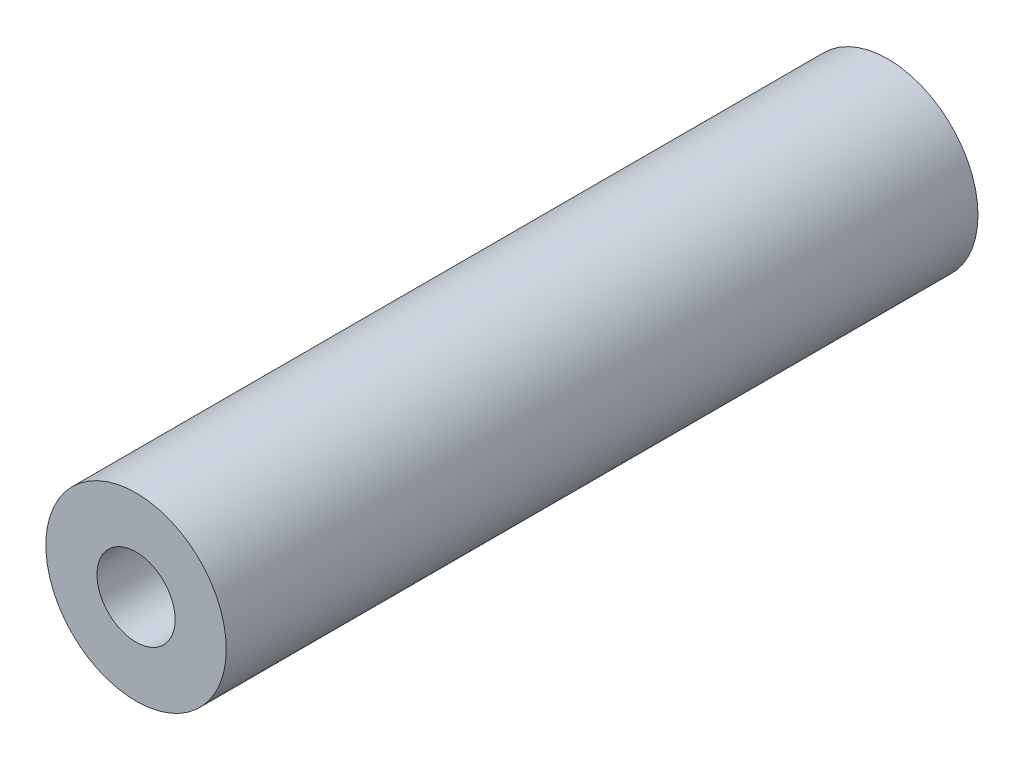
from build123d import *


with BuildPart() as part:
    # Esquisse1 → R_volution1 (revolve)
    with BuildSketch(Plane(origin=(0, 0, 0), x_dir=(1, 0, 0), z_dir=(0, 1, 0))):
        Polygon((2.6, 13), (0, 13), (0, -13), (2.6, -13), (2.6, -25), (6, -25), (6, 25), (2.6, 25), align=None)
    revolve(axis=Axis((0, 0, -25), (0, 0, 1)))


solid = part.part
